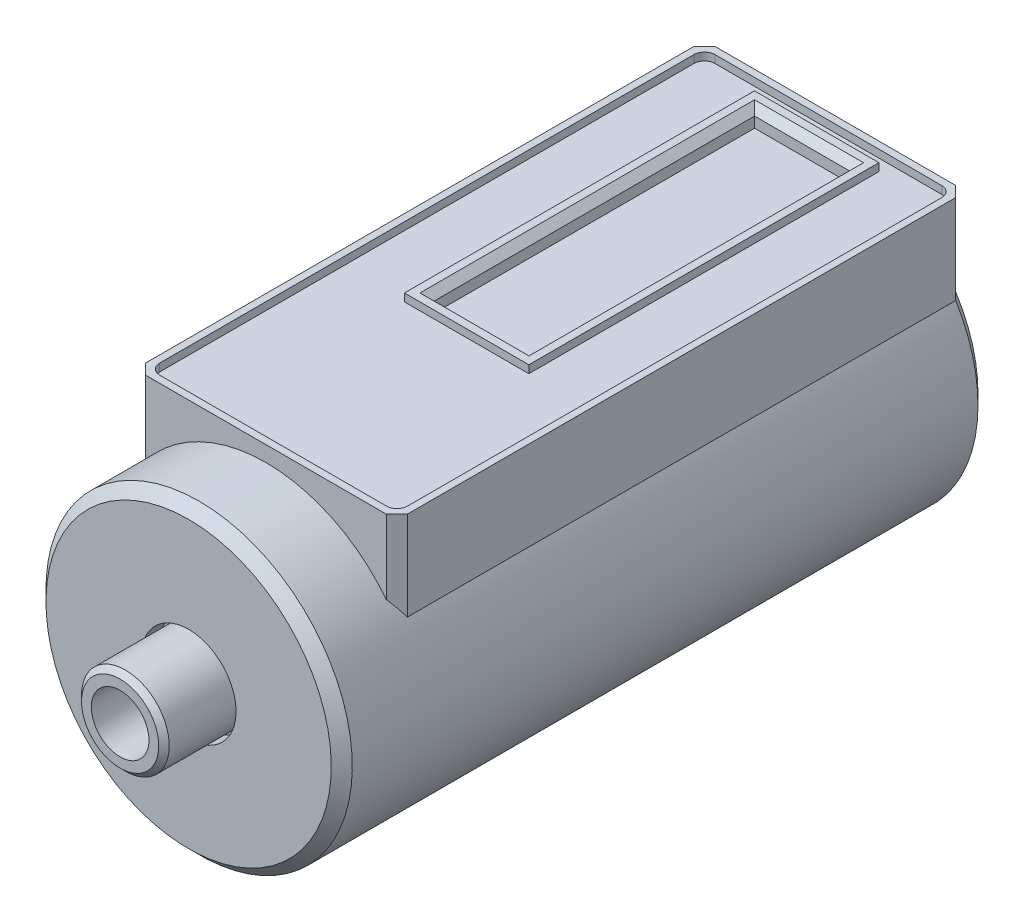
from build123d import *

# Parameters (mm, degrees)
EXTRUDE1_DEPTH     = 12.19
CHAMFER1_SIZE      = 0.76
SKETCH4_W          = 8.99
SKETCH4_H          = 25.3
CUT_EXTRUDE1_DEPTH = 0.56
SKETCH5_W          = 6.86
SKETCH5_H          = 23.16
CUT_EXTRUDE2_DEPTH = 1.27
CHAMFER2_SIZE      = 0.51
HOLE1_D            = 4.1656
HOLE1_DEPTH        = 6.35
HOLE1_TIP          = 1.251472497


with BuildPart() as part:
    # Sketch2 → Revolve1 (revolve)
    with BuildSketch(Plane(origin=(0, 0, 0), x_dir=(0, 0, -1), z_dir=(1, 0, 0))):
        Polygon((64.31, 0), (64.31, 2.79), (64.69, 3.17), (70.53, 3.17), (70.53, 3.43), (69.26, 3.43), (69.26, 10.31), (70.02, 11.07), (116, 11.07), (116, 0), align=None)
    revolve(axis=Axis((0, 0, -116), (0, 0, 1)))

    # Sketch3 → Extrude1 (add)
    with BuildSketch(Plane(origin=(0, 0, 0), x_dir=(1, 0, 0), z_dir=(0, 1, 0))):
        Polygon((-9.46, 116), (9.46, 116), (9.46, 75.61), (8.7, 74.85), (-8.7, 74.85), (-9.46, 75.61), align=None)
    extrude(amount=EXTRUDE1_DEPTH)

    # Chamfer1
    chamfer1_edges = [part.edges().sort_by_distance(p)[0] for p in [
        (0, -11.07, -116),
        (-9.46, 8.969599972, -116),
        (9.46, 8.969599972, -116),
    ]]
    chamfer(chamfer1_edges, length=CHAMFER1_SIZE)

    # Sketch4 → Cut-Extrude1 (cut)
    with BuildSketch(Plane(origin=(0, 12.19, 0), x_dir=(1, 0, 0), z_dir=(0, 1, 0))):
        with BuildLine():
            Line((-8.19, 115.49), (8.2, 115.49))
            ThreePointArc((8.2, 115.49), (8.737401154, 115.267401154), (8.96, 114.73))
            Line((8.96, 114.73), (8.96, 76.12))
            ThreePointArc((8.96, 76.12), (8.737401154, 75.582598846), (8.2, 75.36))
            Line((8.2, 75.36), (-8.19, 75.36))
            ThreePointArc((-8.19, 75.36), (-8.727401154, 75.582598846), (-8.95, 76.12))
            Line((-8.95, 76.12), (-8.95, 114.73))
            ThreePointArc((-8.95, 114.73), (-8.727401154, 115.267401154), (-8.19, 115.49))
        make_face()
        with Locations((0.005, 102)):
            Rectangle(SKETCH4_W, SKETCH4_H, mode=Mode.SUBTRACT)
    extrude(amount=-CUT_EXTRUDE1_DEPTH, mode=Mode.SUBTRACT)

    # Sketch5 → Cut-Extrude2 (cut)
    with BuildSketch(Plane(origin=(0, 12.19, 0), x_dir=(1, 0, 0), z_dir=(0, 1, 0))):
        with Locations((0.01, 102)):
            Rectangle(SKETCH5_W, SKETCH5_H)
    extrude(amount=-CUT_EXTRUDE2_DEPTH, mode=Mode.SUBTRACT)

    # Chamfer2
    chamfer2_edges = [part.edges().sort_by_distance(p)[0] for p in [
        (-3.42, 12.19, -102),
        (0.01, 12.19, -90.42),
        (3.44, 12.19, -102),
        (0.01, 12.19, -113.58),
    ]]
    chamfer(chamfer2_edges, length=CHAMFER2_SIZE)

    # Hole1
    with Locations(Plane.XY.offset(-64.31)):
        with Locations((0, 0)):
            Hole(HOLE1_D / 2, depth=HOLE1_DEPTH)
            with Locations((0, 0, -(HOLE1_DEPTH + HOLE1_TIP / 2))):  # 118° drill point
                Cone(0, HOLE1_D / 2, HOLE1_TIP, mode=Mode.SUBTRACT)


solid = part.part
